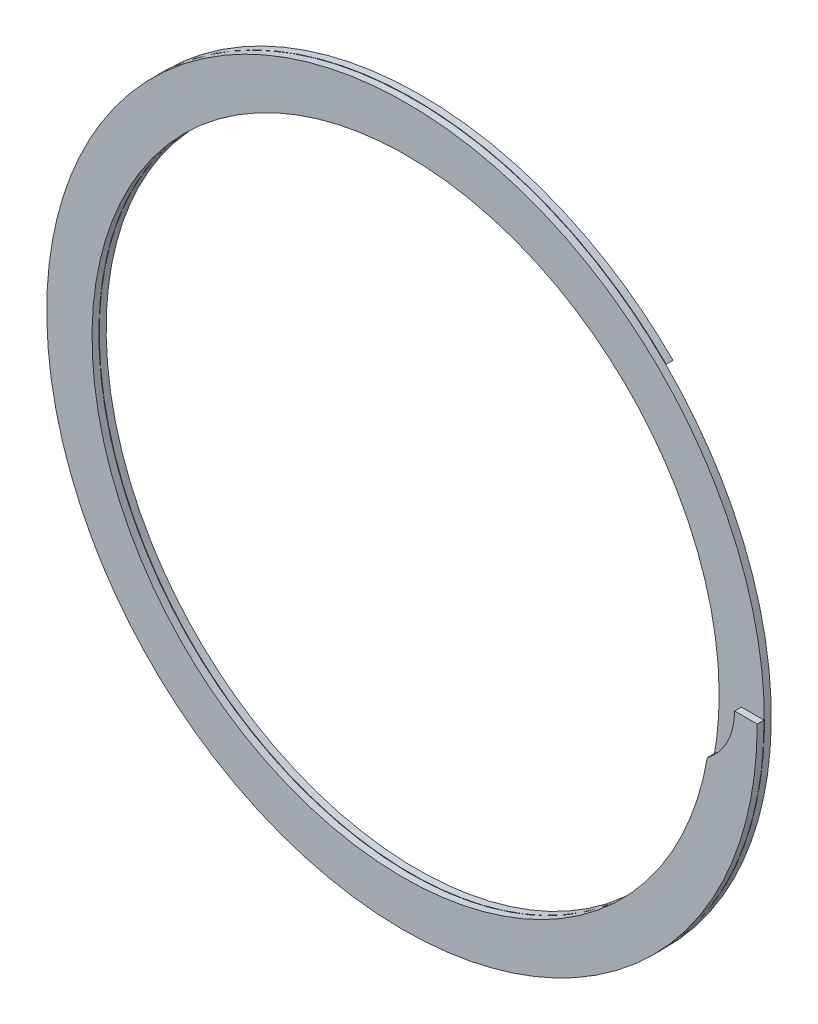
ISO-10303-21;
HEADER;
FILE_DESCRIPTION(('STEP AP214'),'2;1');
FILE_NAME('part.step','',(''),(''),'','','');
FILE_SCHEMA(('AUTOMOTIVE_DESIGN { 1 0 10303 214 1 1 1 1 }'));
ENDSEC;
DATA;
#1=APPLICATION_CONTEXT('core data for automotive mechanical design processes');
#2=APPLICATION_PROTOCOL_DEFINITION('international standard','automotive_design',2000,#1);
#3=PRODUCT_CONTEXT('',#1,'mechanical');
#4=PRODUCT('Part','Part','',(#3));
#5=PRODUCT_RELATED_PRODUCT_CATEGORY('part','',(#4));
#6=PRODUCT_DEFINITION_FORMATION('','',#4);
#7=PRODUCT_DEFINITION_CONTEXT('part definition',#1,'design');
#8=PRODUCT_DEFINITION('design','',#6,#7);
#9=PRODUCT_DEFINITION_SHAPE('','',#8);
#10=(LENGTH_UNIT() NAMED_UNIT(*) SI_UNIT(.MILLI.,.METRE.));
#11=(NAMED_UNIT(*) PLANE_ANGLE_UNIT() SI_UNIT($,.RADIAN.));
#12=(NAMED_UNIT(*) SI_UNIT($,.STERADIAN.) SOLID_ANGLE_UNIT());
#13=UNCERTAINTY_MEASURE_WITH_UNIT(LENGTH_MEASURE(1.E-05),#10,'distance_accuracy_value','');
#14=(GEOMETRIC_REPRESENTATION_CONTEXT(3) GLOBAL_UNCERTAINTY_ASSIGNED_CONTEXT((#13)) GLOBAL_UNIT_ASSIGNED_CONTEXT((#10,
#11,#12)) REPRESENTATION_CONTEXT('',''));
#15=CARTESIAN_POINT('',(0.,0.,0.));
#16=DIRECTION('',(0.,0.,1.));
#17=DIRECTION('',(1.,0.,0.));
#18=AXIS2_PLACEMENT_3D('',#15,#16,#17);
#19=CARTESIAN_POINT('',(13.452423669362,13.4524236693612,-1.0006125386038));
#20=DIRECTION('',(-0.707107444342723,0.70710611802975,0.));
#21=DIRECTION('',(-0.70710611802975,-0.707107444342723,0.));
#22=AXIS2_PLACEMENT_3D('',#19,#20,#21);
#23=PLANE('',#22);
#24=CARTESIAN_POINT('',(12.599300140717,12.5992985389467,-0.727562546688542));
#25=CARTESIAN_POINT('',(12.5993001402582,12.5992985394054,-0.757901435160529));
#26=CARTESIAN_POINT('',(12.5993001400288,12.5992985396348,-0.788240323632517));
#27=CARTESIAN_POINT('',(12.5993001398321,12.5992985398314,-0.848918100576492));
#28=CARTESIAN_POINT('',(12.5993001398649,12.5992985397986,-0.879256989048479));
#29=CARTESIAN_POINT('',(12.5993001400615,12.599298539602,-0.970273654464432));
#30=CARTESIAN_POINT('',(12.5993001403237,12.5992985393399,-1.0309514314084));
#31=CARTESIAN_POINT('',(12.5993001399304,12.5992985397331,-1.09162920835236));
#32=B_SPLINE_CURVE_WITH_KNOTS('',3,(#24,#25,#26,#27,#28,#29,#30,#31),.UNSPECIFIED.,.F.,.F.,(4,2,
2,4),(0.,0.0910166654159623,0.182033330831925,0.36406666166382),.UNSPECIFIED.);
#33=CARTESIAN_POINT('',(12.5993130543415,12.5993106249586,-0.727562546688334));
#34=VERTEX_POINT('',#33);
#35=CARTESIAN_POINT('',(12.599312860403,12.5993108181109,-1.09162921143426));
#36=VERTEX_POINT('',#35);
#37=EDGE_CURVE('E102',#34,#36,#32,.T.);
#38=ORIENTED_EDGE('',*,*,#37,.T.);
#39=CARTESIAN_POINT('',(13.4524249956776,13.4524223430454,-1.09162921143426));
#40=CARTESIAN_POINT('',(11.7461761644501,11.7461738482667,-1.09162921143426));
#41=(BOUNDED_CURVE() B_SPLINE_CURVE(1,(#39,#40),.UNSPECIFIED.,.F.,
.F.) B_SPLINE_CURVE_WITH_KNOTS((2,2),(0.,1.),
.UNSPECIFIED.) CURVE() GEOMETRIC_REPRESENTATION_ITEM() RATIONAL_B_SPLINE_CURVE((0.949184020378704,0.949184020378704)) REPRESENTATION_ITEM(''));
#42=CARTESIAN_POINT('',(13.452423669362,13.4524236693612,-1.09162920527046));
#43=VERTEX_POINT('',#42);
#44=EDGE_CURVE('E111',#36,#43,#41,.F.);
#45=ORIENTED_EDGE('',*,*,#44,.T.);
#46=CARTESIAN_POINT('',(13.452423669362,13.4524236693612,-0.727562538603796));
#47=CARTESIAN_POINT('',(13.452423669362,13.4524236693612,-1.09162920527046));
#48=(BOUNDED_CURVE() B_SPLINE_CURVE(1,(#46,#47),.UNSPECIFIED.,.F.,
.F.) B_SPLINE_CURVE_WITH_KNOTS((2,2),(0.,1.),
.UNSPECIFIED.) CURVE() GEOMETRIC_REPRESENTATION_ITEM() RATIONAL_B_SPLINE_CURVE((0.949184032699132,0.949184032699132)) REPRESENTATION_ITEM(''));
#49=CARTESIAN_POINT('',(13.4524254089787,13.4524219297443,-0.727562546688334));
#50=VERTEX_POINT('',#49);
#51=EDGE_CURVE('E236',#43,#50,#48,.F.);
#52=ORIENTED_EDGE('',*,*,#51,.T.);
#53=CARTESIAN_POINT('',(11.7461765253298,11.7461734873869,-0.727562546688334));
#54=CARTESIAN_POINT('',(13.4524254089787,13.4524219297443,-0.727562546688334));
#55=(BOUNDED_CURVE() B_SPLINE_CURVE(1,(#53,#54),.UNSPECIFIED.,.F.,
.F.) B_SPLINE_CURVE_WITH_KNOTS((2,2),(0.,1.),
.UNSPECIFIED.) CURVE() GEOMETRIC_REPRESENTATION_ITEM() RATIONAL_B_SPLINE_CURVE((0.949184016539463,0.949184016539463)) REPRESENTATION_ITEM(''));
#56=EDGE_CURVE('E115',#50,#34,#55,.F.);
#57=ORIENTED_EDGE('',*,*,#56,.T.);
#58=EDGE_LOOP('',(#38,#45,#52,#57));
#59=FACE_BOUND('',#58,.T.);
#60=ADVANCED_FACE('F44',(#59),#23,.F.);
#61=CARTESIAN_POINT('',(16.6116,0.,-0.364066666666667));
#62=CARTESIAN_POINT('',(16.6116,-9.59071173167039,-0.396428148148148));
#63=CARTESIAN_POINT('',(8.3058,-14.3860675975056,-0.42878962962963));
#64=CARTESIAN_POINT('',(0.,-19.1814234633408,-0.461151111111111));
#65=CARTESIAN_POINT('',(-8.3058,-14.3860675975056,-0.493512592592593));
#66=CARTESIAN_POINT('',(-16.6116,-9.59071173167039,-0.525874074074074));
#67=CARTESIAN_POINT('',(-16.6116,0.,-0.558235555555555));
#68=CARTESIAN_POINT('',(-16.6116,9.59071173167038,-0.590597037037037));
#69=CARTESIAN_POINT('',(-8.30580000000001,14.3860675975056,-0.622958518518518));
#70=CARTESIAN_POINT('',(0.,19.1814234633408,-0.65532));
#71=CARTESIAN_POINT('',(8.30579999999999,14.3860675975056,-0.687681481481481));
#72=CARTESIAN_POINT('',(16.6116,9.5907117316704,-0.720042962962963));
#73=CARTESIAN_POINT('',(16.6116,0.,-0.752404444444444));
#74=CARTESIAN_POINT('',(16.6116,-9.59071173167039,-0.784765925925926));
#75=CARTESIAN_POINT('',(8.3058,-14.3860675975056,-0.817127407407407));
#76=CARTESIAN_POINT('',(0.,-19.1814234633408,-0.849488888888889));
#77=CARTESIAN_POINT('',(-8.3058,-14.3860675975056,-0.88185037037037));
#78=CARTESIAN_POINT('',(-16.6116,-9.59071173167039,-0.914211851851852));
#79=CARTESIAN_POINT('',(-16.6116,0.,-0.946573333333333));
#80=CARTESIAN_POINT('',(-16.6116,9.59071173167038,-0.978934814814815));
#81=CARTESIAN_POINT('',(-8.30580000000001,14.3860675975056,-1.0112962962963));
#82=CARTESIAN_POINT('',(0.,19.1814234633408,-1.04365777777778));
#83=CARTESIAN_POINT('',(8.30579999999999,14.3860675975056,-1.07601925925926));
#84=CARTESIAN_POINT('',(10.1997626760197,13.2925877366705,-1.08339861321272));
#85=CARTESIAN_POINT('',(11.7461765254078,11.7461734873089,-1.09162921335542));
#86=CARTESIAN_POINT('',(16.6116,0.,0.));
#87=CARTESIAN_POINT('',(16.6116,-9.59071173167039,-0.0323614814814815));
#88=CARTESIAN_POINT('',(8.3058,-14.3860675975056,-0.064722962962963));
#89=CARTESIAN_POINT('',(0.,-19.1814234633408,-0.0970844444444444));
#90=CARTESIAN_POINT('',(-8.3058,-14.3860675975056,-0.129445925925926));
#91=CARTESIAN_POINT('',(-16.6116,-9.59071173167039,-0.161807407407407));
#92=CARTESIAN_POINT('',(-16.6116,0.,-0.194168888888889));
#93=CARTESIAN_POINT('',(-16.6116,9.59071173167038,-0.22653037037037));
#94=CARTESIAN_POINT('',(-8.30580000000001,14.3860675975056,-0.258891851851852));
#95=CARTESIAN_POINT('',(0.,19.1814234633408,-0.291253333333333));
#96=CARTESIAN_POINT('',(8.30579999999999,14.3860675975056,-0.323614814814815));
#97=CARTESIAN_POINT('',(16.6116,9.5907117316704,-0.355976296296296));
#98=CARTESIAN_POINT('',(16.6116,0.,-0.388337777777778));
#99=CARTESIAN_POINT('',(16.6116,-9.59071173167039,-0.420699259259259));
#100=CARTESIAN_POINT('',(8.3058,-14.3860675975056,-0.453060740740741));
#101=CARTESIAN_POINT('',(0.,-19.1814234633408,-0.485422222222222));
#102=CARTESIAN_POINT('',(-8.3058,-14.3860675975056,-0.517783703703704));
#103=CARTESIAN_POINT('',(-16.6116,-9.59071173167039,-0.550145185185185));
#104=CARTESIAN_POINT('',(-16.6116,0.,-0.582506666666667));
#105=CARTESIAN_POINT('',(-16.6116,9.59071173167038,-0.614868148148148));
#106=CARTESIAN_POINT('',(-8.30580000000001,14.3860675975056,-0.64722962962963));
#107=CARTESIAN_POINT('',(0.,19.1814234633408,-0.679591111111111));
#108=CARTESIAN_POINT('',(8.30579999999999,14.3860675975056,-0.711952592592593));
#109=CARTESIAN_POINT('',(10.1997626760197,13.2925877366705,-0.71933194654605));
#110=CARTESIAN_POINT('',(11.7461765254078,11.7461734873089,-0.727562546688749));
#111=(BOUNDED_SURFACE() B_SPLINE_SURFACE(1,2,((#61,#62,#63,#64,#65,#66,#67,#68,#69,#70,#71,#72,
#73,#74,#75,#76,#77,#78,#79,#80,#81,#82,#83,#84,#85),(#86,#87,#88,#89,#90,#91,#92,#93,#94,#95,
#96,#97,#98,#99,#100,#101,#102,#103,#104,#105,#106,#107,#108,#109,#110)),.UNSPECIFIED.,.F.,.F.,
.F.) B_SPLINE_SURFACE_WITH_KNOTS((2,2),(3,2,2,2,2,2,2,2,2,2,2,2,3),(0.,1.),(0.,
0.0833333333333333,0.166666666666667,0.25,0.333333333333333,0.416666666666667,0.5,
0.583333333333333,0.666666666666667,0.75,0.833333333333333,0.916666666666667,0.93786110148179),
.UNSPECIFIED.) GEOMETRIC_REPRESENTATION_ITEM() RATIONAL_B_SPLINE_SURFACE(((1.,0.866025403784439,
1.,0.866025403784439,1.,0.866025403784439,1.,0.866025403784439,1.,0.866025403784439,1.,
0.866025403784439,1.,0.866025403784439,1.,0.866025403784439,1.,0.866025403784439,1.,
0.866025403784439,1.,0.866025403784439,1.,0.965925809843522,0.949184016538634),(1.,
0.866025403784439,1.,0.866025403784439,1.,0.866025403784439,1.,0.866025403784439,1.,
0.866025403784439,1.,0.866025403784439,1.,0.866025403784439,1.,0.866025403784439,1.,
0.866025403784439,1.,0.866025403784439,1.,0.866025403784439,1.,0.965925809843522,0.949184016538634))) REPRESENTATION_ITEM('') SURFACE());
#112=DIRECTION('',(-1.47160528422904E-09,2.90979118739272E-09,1.));
#113=VECTOR('',#112,1.);
#114=CARTESIAN_POINT('',(9.52802344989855,13.6074262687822,-1.09162921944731));
#115=LINE('',#114,#113);
#116=CARTESIAN_POINT('',(9.52802233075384,13.6074260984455,-1.08102763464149));
#117=VERTEX_POINT('',#116);
#118=CARTESIAN_POINT('',(9.52802232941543,13.6074260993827,-0.716960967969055));
#119=VERTEX_POINT('',#118);
#120=EDGE_CURVE('E66',#117,#119,#115,.T.);
#121=CARTESIAN_POINT('',(16.6116,0.,0.));
#122=CARTESIAN_POINT('',(16.6116,-9.59071173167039,-0.0323614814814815));
#123=CARTESIAN_POINT('',(8.3058,-14.3860675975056,-0.064722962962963));
#124=CARTESIAN_POINT('',(0.,-19.1814234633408,-0.0970844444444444));
#125=CARTESIAN_POINT('',(-8.3058,-14.3860675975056,-0.129445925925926));
#126=CARTESIAN_POINT('',(-16.6116,-9.59071173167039,-0.161807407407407));
#127=CARTESIAN_POINT('',(-16.6116,0.,-0.194168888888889));
#128=CARTESIAN_POINT('',(-16.6116,9.59071173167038,-0.22653037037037));
#129=CARTESIAN_POINT('',(-8.30580000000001,14.3860675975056,-0.258891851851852));
#130=CARTESIAN_POINT('',(0.,19.1814234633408,-0.291253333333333));
#131=CARTESIAN_POINT('',(8.30579999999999,14.3860675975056,-0.323614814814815));
#132=CARTESIAN_POINT('',(16.6116,9.5907117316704,-0.355976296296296));
#133=CARTESIAN_POINT('',(16.6116,0.,-0.388337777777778));
#134=CARTESIAN_POINT('',(16.6116,-9.59071173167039,-0.420699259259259));
#135=CARTESIAN_POINT('',(8.3058,-14.3860675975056,-0.453060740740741));
#136=CARTESIAN_POINT('',(0.,-19.1814234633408,-0.485422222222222));
#137=CARTESIAN_POINT('',(-8.3058,-14.3860675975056,-0.517783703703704));
#138=CARTESIAN_POINT('',(-16.6116,-9.59071173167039,-0.550145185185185));
#139=CARTESIAN_POINT('',(-16.6116,0.,-0.582506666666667));
#140=CARTESIAN_POINT('',(-16.6116,9.59071173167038,-0.614868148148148));
#141=CARTESIAN_POINT('',(-8.30580000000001,14.3860675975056,-0.64722962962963));
#142=CARTESIAN_POINT('',(0.,19.1814234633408,-0.679591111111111));
#143=CARTESIAN_POINT('',(8.30579999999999,14.3860675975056,-0.711952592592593));
#144=CARTESIAN_POINT('',(10.1997626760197,13.2925877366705,-0.71933194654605));
#145=CARTESIAN_POINT('',(11.7461765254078,11.7461734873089,-0.727562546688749));
#146=(BOUNDED_CURVE() B_SPLINE_CURVE(2,(#121,#122,#123,#124,#125,#126,#127,#128,#129,#130,#131,
#132,#133,#134,#135,#136,#137,#138,#139,#140,#141,#142,#143,#144,#145),.UNSPECIFIED.,.F.,
.F.) B_SPLINE_CURVE_WITH_KNOTS((3,2,2,2,2,2,2,2,2,2,2,2,3),(0.,0.0833333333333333,
0.166666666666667,0.25,0.333333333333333,0.416666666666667,0.5,0.583333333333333,
0.666666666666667,0.75,0.833333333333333,0.916666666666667,0.93786110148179),
.UNSPECIFIED.) CURVE() GEOMETRIC_REPRESENTATION_ITEM() RATIONAL_B_SPLINE_CURVE((1.,
0.866025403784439,1.,0.866025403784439,1.,0.866025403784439,1.,0.866025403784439,1.,
0.866025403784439,1.,0.866025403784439,1.,0.866025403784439,1.,0.866025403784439,1.,
0.866025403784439,1.,0.866025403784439,1.,0.866025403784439,1.,0.965925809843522,0.949184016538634)) REPRESENTATION_ITEM(''));
#147=CARTESIAN_POINT('',(16.3592324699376,-2.88457406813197,-0.0102249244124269));
#148=VERTEX_POINT('',#147);
#149=EDGE_CURVE('E242',#148,#119,#146,.T.);
#150=DIRECTION('',(0.,0.,-1.));
#151=VECTOR('',#150,1.);
#152=CARTESIAN_POINT('',(16.3592324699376,-2.88457406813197,0.));
#153=LINE('',#152,#151);
#154=CARTESIAN_POINT('',(16.3592324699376,-2.88457406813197,-0.374291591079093));
#155=VERTEX_POINT('',#154);
#156=EDGE_CURVE('E396',#148,#155,#153,.T.);
#157=CARTESIAN_POINT('',(16.6116,0.,-0.364066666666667));
#158=CARTESIAN_POINT('',(16.6116,-9.59071173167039,-0.396428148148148));
#159=CARTESIAN_POINT('',(8.3058,-14.3860675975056,-0.42878962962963));
#160=CARTESIAN_POINT('',(0.,-19.1814234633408,-0.461151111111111));
#161=CARTESIAN_POINT('',(-8.3058,-14.3860675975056,-0.493512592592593));
#162=CARTESIAN_POINT('',(-16.6116,-9.59071173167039,-0.525874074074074));
#163=CARTESIAN_POINT('',(-16.6116,0.,-0.558235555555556));
#164=CARTESIAN_POINT('',(-16.6116,9.59071173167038,-0.590597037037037));
#165=CARTESIAN_POINT('',(-8.30580000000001,14.3860675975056,-0.622958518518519));
#166=CARTESIAN_POINT('',(0.,19.1814234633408,-0.65532));
#167=CARTESIAN_POINT('',(8.30579999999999,14.3860675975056,-0.687681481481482));
#168=CARTESIAN_POINT('',(16.6116,9.5907117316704,-0.720042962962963));
#169=CARTESIAN_POINT('',(16.6116,0.,-0.752404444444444));
#170=CARTESIAN_POINT('',(16.6116,-9.59071173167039,-0.784765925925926));
#171=CARTESIAN_POINT('',(8.3058,-14.3860675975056,-0.817127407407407));
#172=CARTESIAN_POINT('',(0.,-19.1814234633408,-0.849488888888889));
#173=CARTESIAN_POINT('',(-8.3058,-14.3860675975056,-0.88185037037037));
#174=CARTESIAN_POINT('',(-16.6116,-9.59071173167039,-0.914211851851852));
#175=CARTESIAN_POINT('',(-16.6116,0.,-0.946573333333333));
#176=CARTESIAN_POINT('',(-16.6116,9.59071173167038,-0.978934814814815));
#177=CARTESIAN_POINT('',(-8.30580000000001,14.3860675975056,-1.0112962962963));
#178=CARTESIAN_POINT('',(0.,19.1814234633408,-1.04365777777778));
#179=CARTESIAN_POINT('',(8.30579999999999,14.3860675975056,-1.07601925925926));
#180=CARTESIAN_POINT('',(10.199762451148,13.2925878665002,-1.08339861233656));
#181=CARTESIAN_POINT('',(11.7461761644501,11.7461738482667,-1.09162921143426));
#182=(BOUNDED_CURVE() B_SPLINE_CURVE(2,(#157,#158,#159,#160,#161,#162,#163,#164,#165,#166,#167,
#168,#169,#170,#171,#172,#173,#174,#175,#176,#177,#178,#179,#180,#181),.UNSPECIFIED.,.F.,
.F.) B_SPLINE_CURVE_WITH_KNOTS((3,2,2,2,2,2,2,2,2,2,2,2,3),(0.,0.0833333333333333,
0.166666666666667,0.25,0.333333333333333,0.416666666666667,0.5,0.583333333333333,
0.666666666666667,0.75,0.833333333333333,0.916666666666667,0.937861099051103),
.UNSPECIFIED.) CURVE() GEOMETRIC_REPRESENTATION_ITEM() RATIONAL_B_SPLINE_CURVE((1.,
0.866025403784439,1.,0.866025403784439,1.,0.866025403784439,1.,0.866025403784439,1.,
0.866025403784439,1.,0.866025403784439,1.,0.866025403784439,1.,0.866025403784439,1.,
0.866025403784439,1.,0.866025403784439,1.,0.866025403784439,1.,0.965925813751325,0.949184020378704)) REPRESENTATION_ITEM(''));
#183=EDGE_CURVE('E124',#155,#117,#182,.T.);
#184=ORIENTED_EDGE('',*,*,#120,.T.);
#185=ORIENTED_EDGE('',*,*,#149,.F.);
#186=ORIENTED_EDGE('',*,*,#156,.T.);
#187=ORIENTED_EDGE('',*,*,#183,.T.);
#188=EDGE_LOOP('',(#184,#185,#186,#187));
#189=FACE_BOUND('',#188,.T.);
#190=ADVANCED_FACE('F155',(#189),#111,.F.);
#191=CARTESIAN_POINT('',(19.0246,0.,-0.364066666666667));
#192=CARTESIAN_POINT('',(19.0246,-10.983857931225,-0.396428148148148));
#193=CARTESIAN_POINT('',(9.5123,-16.4757868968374,-0.42878962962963));
#194=CARTESIAN_POINT('',(0.,-21.9677158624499,-0.461151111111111));
#195=CARTESIAN_POINT('',(-9.5123,-16.4757868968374,-0.493512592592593));
#196=CARTESIAN_POINT('',(-19.0246,-10.983857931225,-0.525874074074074));
#197=CARTESIAN_POINT('',(-19.0246,0.,-0.558235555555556));
#198=CARTESIAN_POINT('',(-19.0246,10.983857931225,-0.590597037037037));
#199=CARTESIAN_POINT('',(-9.51230000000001,16.4757868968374,-0.622958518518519));
#200=CARTESIAN_POINT('',(0.,21.9677158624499,-0.65532));
#201=CARTESIAN_POINT('',(9.51229999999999,16.4757868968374,-0.687681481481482));
#202=CARTESIAN_POINT('',(19.0246,10.983857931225,-0.720042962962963));
#203=CARTESIAN_POINT('',(19.0246,0.,-0.752404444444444));
#204=CARTESIAN_POINT('',(19.0246,-10.983857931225,-0.784765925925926));
#205=CARTESIAN_POINT('',(9.5123,-16.4757868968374,-0.817127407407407));
#206=CARTESIAN_POINT('',(0.,-21.9677158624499,-0.849488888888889));
#207=CARTESIAN_POINT('',(-9.5123,-16.4757868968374,-0.88185037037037));
#208=CARTESIAN_POINT('',(-19.0246,-10.983857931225,-0.914211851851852));
#209=CARTESIAN_POINT('',(-19.0246,0.,-0.946573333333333));
#210=CARTESIAN_POINT('',(-19.0246,10.983857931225,-0.978934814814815));
#211=CARTESIAN_POINT('',(-9.51230000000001,16.4757868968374,-1.0112962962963));
#212=CARTESIAN_POINT('',(0.,21.9677158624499,-1.04365777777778));
#213=CARTESIAN_POINT('',(9.51229999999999,16.4757868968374,-1.07601925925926));
#214=CARTESIAN_POINT('',(11.6813793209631,15.2234683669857,-1.08339861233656));
#215=CARTESIAN_POINT('',(13.4524249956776,13.4524223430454,-1.09162921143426));
#216=CARTESIAN_POINT('',(16.6116,0.,-0.364066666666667));
#217=CARTESIAN_POINT('',(16.6116,-9.59071173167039,-0.396428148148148));
#218=CARTESIAN_POINT('',(8.3058,-14.3860675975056,-0.42878962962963));
#219=CARTESIAN_POINT('',(0.,-19.1814234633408,-0.461151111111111));
#220=CARTESIAN_POINT('',(-8.3058,-14.3860675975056,-0.493512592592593));
#221=CARTESIAN_POINT('',(-16.6116,-9.59071173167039,-0.525874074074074));
#222=CARTESIAN_POINT('',(-16.6116,0.,-0.558235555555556));
#223=CARTESIAN_POINT('',(-16.6116,9.59071173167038,-0.590597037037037));
#224=CARTESIAN_POINT('',(-8.30580000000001,14.3860675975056,-0.622958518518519));
#225=CARTESIAN_POINT('',(0.,19.1814234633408,-0.65532));
#226=CARTESIAN_POINT('',(8.30579999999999,14.3860675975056,-0.687681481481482));
#227=CARTESIAN_POINT('',(16.6116,9.5907117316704,-0.720042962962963));
#228=CARTESIAN_POINT('',(16.6116,0.,-0.752404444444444));
#229=CARTESIAN_POINT('',(16.6116,-9.59071173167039,-0.784765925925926));
#230=CARTESIAN_POINT('',(8.3058,-14.3860675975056,-0.817127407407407));
#231=CARTESIAN_POINT('',(0.,-19.1814234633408,-0.849488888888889));
#232=CARTESIAN_POINT('',(-8.3058,-14.3860675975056,-0.88185037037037));
#233=CARTESIAN_POINT('',(-16.6116,-9.59071173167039,-0.914211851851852));
#234=CARTESIAN_POINT('',(-16.6116,0.,-0.946573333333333));
#235=CARTESIAN_POINT('',(-16.6116,9.59071173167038,-0.978934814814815));
#236=CARTESIAN_POINT('',(-8.30580000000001,14.3860675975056,-1.0112962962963));
#237=CARTESIAN_POINT('',(0.,19.1814234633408,-1.04365777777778));
#238=CARTESIAN_POINT('',(8.30579999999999,14.3860675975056,-1.07601925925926));
#239=CARTESIAN_POINT('',(10.199762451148,13.2925878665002,-1.08339861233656));
#240=CARTESIAN_POINT('',(11.7461761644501,11.7461738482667,-1.09162921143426));
#241=(BOUNDED_SURFACE() B_SPLINE_SURFACE(1,2,((#191,#192,#193,#194,#195,#196,#197,#198,#199,
#200,#201,#202,#203,#204,#205,#206,#207,#208,#209,#210,#211,#212,#213,#214,#215),(#216,#217,
#218,#219,#220,#221,#222,#223,#224,#225,#226,#227,#228,#229,#230,#231,#232,#233,#234,#235,#236,
#237,#238,#239,#240)),.UNSPECIFIED.,.F.,.F.,.F.) B_SPLINE_SURFACE_WITH_KNOTS((2,2),(3,2,2,2,2,2,
2,2,2,2,2,2,3),(0.,1.),(0.,0.0833333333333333,0.166666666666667,0.25,0.333333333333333,
0.416666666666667,0.5,0.583333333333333,0.666666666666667,0.75,0.833333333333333,
0.916666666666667,0.937861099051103),
.UNSPECIFIED.) GEOMETRIC_REPRESENTATION_ITEM() RATIONAL_B_SPLINE_SURFACE(((1.,0.866025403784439,
1.,0.866025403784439,1.,0.866025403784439,1.,0.866025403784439,1.,0.866025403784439,1.,
0.866025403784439,1.,0.866025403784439,1.,0.866025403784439,1.,0.866025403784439,1.,
0.866025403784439,1.,0.866025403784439,1.,0.965925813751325,0.949184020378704),(1.,
0.866025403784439,1.,0.866025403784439,1.,0.866025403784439,1.,0.866025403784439,1.,
0.866025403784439,1.,0.866025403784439,1.,0.866025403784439,1.,0.866025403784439,1.,
0.866025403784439,1.,0.866025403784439,1.,0.866025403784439,1.,0.965925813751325,0.949184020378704))) REPRESENTATION_ITEM('') SURFACE());
#242=CARTESIAN_POINT('',(9.52802344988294,13.6074262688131,-1.08102763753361));
#243=CARTESIAN_POINT('',(9.64876909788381,13.6257685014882,-1.08133981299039));
#244=CARTESIAN_POINT('',(9.77045577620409,13.6377511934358,-1.08166388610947));
#245=CARTESIAN_POINT('',(10.0146305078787,13.6492592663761,-1.08233343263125));
#246=CARTESIAN_POINT('',(10.1371195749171,13.6487633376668,-1.08267894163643));
#247=CARTESIAN_POINT('',(10.3606324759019,13.6366411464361,-1.08332761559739));
#248=CARTESIAN_POINT('',(10.4617652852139,13.6269214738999,-1.0836279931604));
#249=CARTESIAN_POINT('',(10.6628934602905,13.5990510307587,-1.08424010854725));
#250=CARTESIAN_POINT('',(10.7628885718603,13.5808984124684,-1.08455184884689));
#251=CARTESIAN_POINT('',(10.9610729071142,13.5361248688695,-1.08518588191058));
#252=CARTESIAN_POINT('',(11.0592603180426,13.5094958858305,-1.08550818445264));
#253=CARTESIAN_POINT('',(11.2528932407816,13.4476973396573,-1.08616205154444));
#254=CARTESIAN_POINT('',(11.3483391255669,13.4125289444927,-1.08649361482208));
#255=CARTESIAN_POINT('',(11.5346767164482,13.3346463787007,-1.08716013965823));
#256=CARTESIAN_POINT('',(11.6256109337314,13.2920339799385,-1.08749500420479));
#257=CARTESIAN_POINT('',(11.8036317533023,13.1994577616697,-1.08817071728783));
#258=CARTESIAN_POINT('',(11.890717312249,13.1494919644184,-1.08851156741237));
#259=CARTESIAN_POINT('',(12.1450704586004,12.9892871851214,-1.08954018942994));
#260=CARTESIAN_POINT('',(12.3060022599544,12.8685017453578,-1.09023605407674));
#261=CARTESIAN_POINT('',(12.4799581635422,12.7132922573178,-1.09105090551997));
#262=CARTESIAN_POINT('',(12.5042948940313,12.6909563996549,-1.09116648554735));
#263=CARTESIAN_POINT('',(12.5522963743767,12.6456271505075,-1.09139773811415));
#264=CARTESIAN_POINT('',(12.5759618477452,12.6226345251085,-1.09151341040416));
#265=CARTESIAN_POINT('',(12.5993001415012,12.5992985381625,-1.09162920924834));
#266=B_SPLINE_CURVE_WITH_KNOTS('',3,(#242,#243,#244,#245,#246,#247,#248,#249,#250,#251,#252,
#253,#254,#255,#256,#257,#258,#259,#260,#261,#262,#263,#264,#265),.UNSPECIFIED.,.F.,.F.,(4,2,2,
2,2,2,2,2,2,2,2,4),(0.,0.366197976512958,0.733021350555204,1.03748147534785,1.3420083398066,
1.6468255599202,1.9516011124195,2.25249633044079,2.55347262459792,3.15359686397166,
3.25269372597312,3.35167937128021),.UNSPECIFIED.);
#267=EDGE_CURVE('E59',#117,#36,#266,.T.);
#268=CARTESIAN_POINT('',(17.7102009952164,2.18235442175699,-0.357159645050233));
#269=CARTESIAN_POINT('',(17.7229068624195,1.9399773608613,-0.35793170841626));
#270=CARTESIAN_POINT('',(17.7356064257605,1.69759993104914,-0.358702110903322));
#271=CARTESIAN_POINT('',(17.750427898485,1.41477895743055,-0.359599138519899));
#272=CARTESIAN_POINT('',(17.752547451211,1.37433528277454,-0.359727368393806));
#273=CARTESIAN_POINT('',(17.7567867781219,1.29344784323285,-0.359983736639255));
#274=CARTESIAN_POINT('',(17.7589065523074,1.2530040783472,-0.360111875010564));
#275=CARTESIAN_POINT('',(17.7631454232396,1.17211034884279,-0.360368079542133));
#276=CARTESIAN_POINT('',(17.7652645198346,1.13166038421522,-0.360496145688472));
#277=CARTESIAN_POINT('',(17.7684459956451,1.07098570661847,-0.360688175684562));
#278=CARTESIAN_POINT('',(17.7695069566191,1.05076091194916,-0.360752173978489));
#279=CARTESIAN_POINT('',(17.7716237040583,1.01031105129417,-0.360880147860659));
#280=CARTESIAN_POINT('',(17.7726794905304,0.990085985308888,-0.360944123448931));
#281=CARTESIAN_POINT('',(17.7759618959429,0.929404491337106,-0.361136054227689));
#282=CARTESIAN_POINT('',(17.7783029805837,0.888954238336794,-0.361263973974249));
#283=CARTESIAN_POINT('',(17.7831246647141,0.808062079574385,-0.361519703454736));
#284=CARTESIAN_POINT('',(17.7856052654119,0.767620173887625,-0.361647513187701));
#285=CARTESIAN_POINT('',(17.7930530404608,0.646421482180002,-0.362030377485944));
#286=CARTESIAN_POINT('',(17.7980339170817,0.565665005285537,-0.36228526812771));
#287=CARTESIAN_POINT('',(17.8046965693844,0.444497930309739,-0.362667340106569));
#288=CARTESIAN_POINT('',(17.8067823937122,0.404110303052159,-0.362794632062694));
#289=CARTESIAN_POINT('',(17.8105429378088,0.323314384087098,-0.363049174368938));
#290=CARTESIAN_POINT('',(17.8122176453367,0.282906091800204,-0.363176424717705));
#291=CARTESIAN_POINT('',(17.8150157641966,0.202087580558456,-0.363430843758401));
#292=CARTESIAN_POINT('',(17.8161394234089,0.161677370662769,-0.3635580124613));
#293=CARTESIAN_POINT('',(17.8172916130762,0.101052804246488,-0.363748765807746));
#294=CARTESIAN_POINT('',(17.8175867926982,0.0808433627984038,-0.363812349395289));
#295=CARTESIAN_POINT('',(17.818000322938,0.0404226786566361,-0.363939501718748));
#296=CARTESIAN_POINT('',(17.8181186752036,0.0202114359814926,-0.364003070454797));
#297=CARTESIAN_POINT('',(17.8180858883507,-0.0152722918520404,-0.36411472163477));
#298=CARTESIAN_POINT('',(17.8179935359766,-0.0305447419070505,-0.36416279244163));
#299=CARTESIAN_POINT('',(17.8175942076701,-0.0610866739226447,-0.364259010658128));
#300=CARTESIAN_POINT('',(17.8172872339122,-0.0763561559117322,-0.364307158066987));
#301=CARTESIAN_POINT('',(17.8160683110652,-0.122155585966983,-0.364451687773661));
#302=CARTESIAN_POINT('',(17.8148583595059,-0.152678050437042,-0.364548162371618));
#303=CARTESIAN_POINT('',(17.8116423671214,-0.213678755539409,-0.364741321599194));
#304=CARTESIAN_POINT('',(17.8096363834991,-0.24415699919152,-0.364838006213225));
#305=CARTESIAN_POINT('',(17.8048406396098,-0.305052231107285,-0.36503155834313));
#306=CARTESIAN_POINT('',(17.8020508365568,-0.335469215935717,-0.365128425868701));
#307=CARTESIAN_POINT('',(17.7925123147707,-0.426641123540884,-0.365419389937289));
#308=CARTESIAN_POINT('',(17.7845964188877,-0.48728061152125,-0.365613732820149));
#309=CARTESIAN_POINT('',(17.7657164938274,-0.608081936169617,-0.36600275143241));
#310=CARTESIAN_POINT('',(17.7547513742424,-0.668243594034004,-0.366197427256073));
#311=CARTESIAN_POINT('',(17.7007720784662,-0.927336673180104,-0.367040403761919));
#312=CARTESIAN_POINT('',(17.6425476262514,-1.12346977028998,-0.367690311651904));
#313=CARTESIAN_POINT('',(17.5311206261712,-1.40776826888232,-0.368656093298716));
#314=CARTESIAN_POINT('',(17.4899560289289,-1.50089619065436,-0.368976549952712));
#315=CARTESIAN_POINT('',(17.3995511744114,-1.68320599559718,-0.369613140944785));
#316=CARTESIAN_POINT('',(17.3503110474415,-1.77238794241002,-0.369929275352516));
#317=CARTESIAN_POINT('',(17.2626041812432,-1.91625992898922,-0.370447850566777));
#318=CARTESIAN_POINT('',(17.2262578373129,-1.97226226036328,-0.370651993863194));
#319=CARTESIAN_POINT('',(17.1505092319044,-2.08217199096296,-0.371057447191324));
#320=CARTESIAN_POINT('',(17.1111068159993,-2.13607928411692,-0.371258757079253));
#321=CARTESIAN_POINT('',(17.0293992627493,-2.24164401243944,-0.371658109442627));
#322=CARTESIAN_POINT('',(16.9870940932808,-2.29330142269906,-0.371856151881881));
#323=CARTESIAN_POINT('',(16.8994917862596,-2.39448080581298,-0.372249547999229));
#324=CARTESIAN_POINT('',(16.8541805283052,-2.44399058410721,-0.372444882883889));
#325=CARTESIAN_POINT('',(16.7842238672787,-2.51630992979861,-0.372734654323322));
#326=CARTESIAN_POINT('',(16.7605747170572,-2.54009089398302,-0.372830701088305));
#327=CARTESIAN_POINT('',(16.7126229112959,-2.5869888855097,-0.373021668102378));
#328=CARTESIAN_POINT('',(16.6883202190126,-2.6101058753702,-0.373116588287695));
#329=CARTESIAN_POINT('',(16.6390881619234,-2.65564197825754,-0.37330517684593));
#330=CARTESIAN_POINT('',(16.6141590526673,-2.67806136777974,-0.373398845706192));
#331=CARTESIAN_POINT('',(16.5636814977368,-2.72218642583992,-0.373584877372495));
#332=CARTESIAN_POINT('',(16.5381331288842,-2.74389218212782,-0.37367724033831));
#333=CARTESIAN_POINT('',(16.4993772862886,-2.77587941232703,-0.373814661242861));
#334=CARTESIAN_POINT('',(16.4863975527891,-2.78643794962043,-0.373860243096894));
#335=CARTESIAN_POINT('',(16.460289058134,-2.80736843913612,-0.373951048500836));
#336=CARTESIAN_POINT('',(16.4471603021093,-2.81774039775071,-0.37399627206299));
#337=CARTESIAN_POINT('',(16.4207518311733,-2.83829366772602,-0.374086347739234));
#338=CARTESIAN_POINT('',(16.4074720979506,-2.84847495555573,-0.3741311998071));
#339=CARTESIAN_POINT('',(16.3874463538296,-2.86360673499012,-0.374198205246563));
#340=CARTESIAN_POINT('',(16.3807532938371,-2.8686273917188,-0.374220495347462));
#341=CARTESIAN_POINT('',(16.3673240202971,-2.87861072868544,-0.374264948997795));
#342=CARTESIAN_POINT('',(16.36058780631,-2.88357340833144,-0.374287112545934));
#343=CARTESIAN_POINT('',(16.340367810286,-2.89846085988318,-0.374353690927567));
#344=CARTESIAN_POINT('',(16.3268798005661,-2.90837978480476,-0.374398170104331));
#345=CARTESIAN_POINT('',(16.2999069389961,-2.92822156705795,-0.374487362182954));
#346=CARTESIAN_POINT('',(16.2864220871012,-2.93814442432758,-0.374532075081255));
#347=CARTESIAN_POINT('',(16.2459679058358,-2.96791100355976,-0.37466654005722));
#348=CARTESIAN_POINT('',(16.2189977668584,-2.98775360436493,-0.374756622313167));
#349=CARTESIAN_POINT('',(16.1650465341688,-3.027448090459,-0.374937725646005));
#350=CARTESIAN_POINT('',(16.1380654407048,-3.04729997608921,-0.375028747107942));
#351=CARTESIAN_POINT('',(16.0841027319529,-3.08700381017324,-0.375211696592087));
#352=CARTESIAN_POINT('',(16.0571211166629,-3.10685575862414,-0.375303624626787));
#353=CARTESIAN_POINT('',(15.9768423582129,-3.1659216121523,-0.37557849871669));
#354=CARTESIAN_POINT('',(15.9235452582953,-3.20513557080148,-0.375762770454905));
#355=CARTESIAN_POINT('',(15.8169803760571,-3.28354185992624,-0.376134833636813));
#356=CARTESIAN_POINT('',(15.763712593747,-3.32273419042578,-0.376322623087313));
#357=CARTESIAN_POINT('',(15.6572360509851,-3.40107542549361,-0.376701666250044));
#358=CARTESIAN_POINT('',(15.6040272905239,-3.44022433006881,-0.376892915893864));
#359=CARTESIAN_POINT('',(15.5508185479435,-3.47937325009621,-0.377086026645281));
#360=B_SPLINE_CURVE_WITH_KNOTS('',3,(#268,#269,#270,#271,#272,#273,#274,#275,#276,#277,#278,
#279,#280,#281,#282,#283,#284,#285,#286,#287,#288,#289,#290,#291,#292,#293,#294,#295,#296,#297,
#298,#299,#300,#301,#302,#303,#304,#305,#306,#307,#308,#309,#310,#311,#312,#313,#314,#315,#316,
#317,#318,#319,#320,#321,#322,#323,#324,#325,#326,#327,#328,#329,#330,#331,#332,#333,#334,#335,
#336,#337,#338,#339,#340,#341,#342,#343,#344,#345,#346,#347,#348,#349,#350,#351,#352,#353,#354,
#355,#356,#357,#358,#359),.UNSPECIFIED.,.F.,.F.,(4,2,2,2,2,2,2,2,2,2,2,2,2,2,2,2,2,2,2,2,2,2,2,
2,2,2,2,2,2,2,2,2,2,2,2,2,2,2,2,2,2,2,2,2,2,4),(0.,0.728133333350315,0.849631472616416,
0.971129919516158,1.09264681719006,1.15340494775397,1.21416299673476,1.33571654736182,
1.45727115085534,1.69999949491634,1.82132289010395,1.94264989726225,2.06392227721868,
2.12455673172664,2.18519062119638,2.23100776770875,2.27682445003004,2.36845321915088,
2.46007540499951,2.55170259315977,2.73506616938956,2.9184954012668,3.52869230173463,
3.83387346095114,4.13904969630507,4.33925110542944,4.53946263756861,4.73967638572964,
4.94090823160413,5.04151300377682,5.14212344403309,5.24269348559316,5.34325111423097,
5.39344558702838,5.44363833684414,5.49383724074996,5.51893759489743,5.54403820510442,
5.59426599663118,5.64449302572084,5.74494267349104,5.8454352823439,5.94592927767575,
6.14443656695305,6.34283459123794,6.5410128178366),.UNSPECIFIED.);
#361=CARTESIAN_POINT('',(17.8218632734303,0.,-0.364066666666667));
#362=VERTEX_POINT('',#361);
#363=EDGE_CURVE('E107',#362,#155,#360,.T.);
#364=DIRECTION('',(-1.,0.,0.));
#365=VECTOR('',#364,1.);
#366=CARTESIAN_POINT('',(17.8181,0.,-0.364066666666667));
#367=LINE('',#366,#365);
#368=CARTESIAN_POINT('',(19.0246,0.,-0.364066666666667));
#369=VERTEX_POINT('',#368);
#370=EDGE_CURVE('E125',#369,#362,#367,.T.);
#371=CARTESIAN_POINT('',(19.0246,0.,-0.364066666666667));
#372=CARTESIAN_POINT('',(19.0246,-10.983857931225,-0.396428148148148));
#373=CARTESIAN_POINT('',(9.5123,-16.4757868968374,-0.42878962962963));
#374=CARTESIAN_POINT('',(0.,-21.9677158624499,-0.461151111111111));
#375=CARTESIAN_POINT('',(-9.5123,-16.4757868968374,-0.493512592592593));
#376=CARTESIAN_POINT('',(-19.0246,-10.983857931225,-0.525874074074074));
#377=CARTESIAN_POINT('',(-19.0246,0.,-0.558235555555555));
#378=CARTESIAN_POINT('',(-19.0246,10.983857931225,-0.590597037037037));
#379=CARTESIAN_POINT('',(-9.51230000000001,16.4757868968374,-0.622958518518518));
#380=CARTESIAN_POINT('',(0.,21.9677158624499,-0.65532));
#381=CARTESIAN_POINT('',(9.51229999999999,16.4757868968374,-0.687681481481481));
#382=CARTESIAN_POINT('',(19.0246,10.983857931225,-0.720042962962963));
#383=CARTESIAN_POINT('',(19.0246,0.,-0.752404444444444));
#384=CARTESIAN_POINT('',(19.0246,-10.983857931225,-0.784765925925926));
#385=CARTESIAN_POINT('',(9.5123,-16.4757868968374,-0.817127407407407));
#386=CARTESIAN_POINT('',(0.,-21.9677158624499,-0.849488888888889));
#387=CARTESIAN_POINT('',(-9.5123,-16.4757868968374,-0.88185037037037));
#388=CARTESIAN_POINT('',(-19.0246,-10.983857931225,-0.914211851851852));
#389=CARTESIAN_POINT('',(-19.0246,0.,-0.946573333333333));
#390=CARTESIAN_POINT('',(-19.0246,10.983857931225,-0.978934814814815));
#391=CARTESIAN_POINT('',(-9.51230000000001,16.4757868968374,-1.0112962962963));
#392=CARTESIAN_POINT('',(0.,21.9677158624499,-1.04365777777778));
#393=CARTESIAN_POINT('',(9.51229999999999,16.4757868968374,-1.07601925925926));
#394=CARTESIAN_POINT('',(11.6813784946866,15.2234688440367,-1.08339860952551));
#395=CARTESIAN_POINT('',(13.452423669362,13.4524236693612,-1.09162920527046));
#396=(BOUNDED_CURVE() B_SPLINE_CURVE(2,(#371,#372,#373,#374,#375,#376,#377,#378,#379,#380,#381,
#382,#383,#384,#385,#386,#387,#388,#389,#390,#391,#392,#393,#394,#395),.UNSPECIFIED.,.F.,
.F.) B_SPLINE_CURVE_WITH_KNOTS((3,2,2,2,2,2,2,2,2,2,2,2,3),(0.,0.0833333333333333,
0.166666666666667,0.25,0.333333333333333,0.416666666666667,0.5,0.583333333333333,
0.666666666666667,0.75,0.833333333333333,0.916666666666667,0.937861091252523),
.UNSPECIFIED.) CURVE() GEOMETRIC_REPRESENTATION_ITEM() RATIONAL_B_SPLINE_CURVE((1.,
0.866025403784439,1.,0.866025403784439,1.,0.866025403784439,1.,0.866025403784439,1.,
0.866025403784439,1.,0.866025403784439,1.,0.866025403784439,1.,0.866025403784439,1.,
0.866025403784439,1.,0.866025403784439,1.,0.866025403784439,1.,0.965925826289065,0.949184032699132)) REPRESENTATION_ITEM(''));
#397=EDGE_CURVE('E122',#369,#43,#396,.T.);
#398=ORIENTED_EDGE('',*,*,#267,.F.);
#399=ORIENTED_EDGE('',*,*,#183,.F.);
#400=ORIENTED_EDGE('',*,*,#363,.F.);
#401=ORIENTED_EDGE('',*,*,#370,.F.);
#402=ORIENTED_EDGE('',*,*,#397,.T.);
#403=ORIENTED_EDGE('',*,*,#44,.F.);
#404=EDGE_LOOP('',(#398,#399,#400,#401,#402,#403));
#405=FACE_BOUND('',#404,.T.);
#406=ADVANCED_FACE('F120',(#405),#241,.F.);
#407=CARTESIAN_POINT('',(19.0246,0.,-0.182033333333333));
#408=DIRECTION('',(0.,1.,0.));
#409=DIRECTION('',(0.,0.,1.));
#410=AXIS2_PLACEMENT_3D('',#407,#408,#409);
#411=PLANE('',#410);
#412=ORIENTED_EDGE('',*,*,#370,.T.);
#413=DIRECTION('',(0.,0.,-1.));
#414=VECTOR('',#413,1.);
#415=CARTESIAN_POINT('',(17.8181,0.,-0.182033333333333));
#416=LINE('',#415,#414);
#417=CARTESIAN_POINT('',(17.8218632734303,0.,0.));
#418=VERTEX_POINT('',#417);
#419=EDGE_CURVE('E117',#362,#418,#416,.F.);
#420=ORIENTED_EDGE('',*,*,#419,.T.);
#421=DIRECTION('',(1.,0.,0.));
#422=VECTOR('',#421,1.);
#423=CARTESIAN_POINT('',(17.8181,0.,0.));
#424=LINE('',#423,#422);
#425=CARTESIAN_POINT('',(19.0246,0.,0.));
#426=VERTEX_POINT('',#425);
#427=EDGE_CURVE('E246',#418,#426,#424,.T.);
#428=ORIENTED_EDGE('',*,*,#427,.T.);
#429=DIRECTION('',(0.,0.,-1.));
#430=VECTOR('',#429,1.);
#431=CARTESIAN_POINT('',(19.0246,0.,-0.182033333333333));
#432=LINE('',#431,#430);
#433=EDGE_CURVE('E228',#426,#369,#432,.T.);
#434=ORIENTED_EDGE('',*,*,#433,.T.);
#435=EDGE_LOOP('',(#412,#420,#428,#434));
#436=FACE_BOUND('',#435,.T.);
#437=ADVANCED_FACE('F154',(#436),#411,.T.);
#438=CARTESIAN_POINT('',(19.0246,0.,0.));
#439=CARTESIAN_POINT('',(19.0246,-10.983857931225,-0.0323614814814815));
#440=CARTESIAN_POINT('',(9.5123,-16.4757868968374,-0.064722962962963));
#441=CARTESIAN_POINT('',(0.,-21.9677158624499,-0.0970844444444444));
#442=CARTESIAN_POINT('',(-9.5123,-16.4757868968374,-0.129445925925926));
#443=CARTESIAN_POINT('',(-19.0246,-10.983857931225,-0.161807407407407));
#444=CARTESIAN_POINT('',(-19.0246,0.,-0.194168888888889));
#445=CARTESIAN_POINT('',(-19.0246,10.983857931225,-0.22653037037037));
#446=CARTESIAN_POINT('',(-9.51230000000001,16.4757868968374,-0.258891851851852));
#447=CARTESIAN_POINT('',(0.,21.9677158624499,-0.291253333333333));
#448=CARTESIAN_POINT('',(9.51229999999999,16.4757868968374,-0.323614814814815));
#449=CARTESIAN_POINT('',(19.0246,10.983857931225,-0.355976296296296));
#450=CARTESIAN_POINT('',(19.0246,0.,-0.388337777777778));
#451=CARTESIAN_POINT('',(19.0246,-10.983857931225,-0.420699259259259));
#452=CARTESIAN_POINT('',(9.5123,-16.4757868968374,-0.453060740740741));
#453=CARTESIAN_POINT('',(0.,-21.9677158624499,-0.485422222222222));
#454=CARTESIAN_POINT('',(-9.5123,-16.4757868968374,-0.517783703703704));
#455=CARTESIAN_POINT('',(-19.0246,-10.983857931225,-0.550145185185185));
#456=CARTESIAN_POINT('',(-19.0246,0.,-0.582506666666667));
#457=CARTESIAN_POINT('',(-19.0246,10.983857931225,-0.614868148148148));
#458=CARTESIAN_POINT('',(-9.51230000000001,16.4757868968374,-0.64722962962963));
#459=CARTESIAN_POINT('',(0.,21.9677158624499,-0.679591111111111));
#460=CARTESIAN_POINT('',(9.51229999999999,16.4757868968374,-0.711952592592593));
#461=CARTESIAN_POINT('',(11.6813784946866,15.2234688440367,-0.719331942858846));
#462=CARTESIAN_POINT('',(13.452423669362,13.4524236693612,-0.727562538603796));
#463=CARTESIAN_POINT('',(19.0246,0.,-0.364066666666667));
#464=CARTESIAN_POINT('',(19.0246,-10.983857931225,-0.396428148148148));
#465=CARTESIAN_POINT('',(9.5123,-16.4757868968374,-0.42878962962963));
#466=CARTESIAN_POINT('',(0.,-21.9677158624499,-0.461151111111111));
#467=CARTESIAN_POINT('',(-9.5123,-16.4757868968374,-0.493512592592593));
#468=CARTESIAN_POINT('',(-19.0246,-10.983857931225,-0.525874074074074));
#469=CARTESIAN_POINT('',(-19.0246,0.,-0.558235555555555));
#470=CARTESIAN_POINT('',(-19.0246,10.983857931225,-0.590597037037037));
#471=CARTESIAN_POINT('',(-9.51230000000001,16.4757868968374,-0.622958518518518));
#472=CARTESIAN_POINT('',(0.,21.9677158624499,-0.65532));
#473=CARTESIAN_POINT('',(9.51229999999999,16.4757868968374,-0.687681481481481));
#474=CARTESIAN_POINT('',(19.0246,10.983857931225,-0.720042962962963));
#475=CARTESIAN_POINT('',(19.0246,0.,-0.752404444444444));
#476=CARTESIAN_POINT('',(19.0246,-10.983857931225,-0.784765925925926));
#477=CARTESIAN_POINT('',(9.5123,-16.4757868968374,-0.817127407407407));
#478=CARTESIAN_POINT('',(0.,-21.9677158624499,-0.849488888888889));
#479=CARTESIAN_POINT('',(-9.5123,-16.4757868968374,-0.88185037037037));
#480=CARTESIAN_POINT('',(-19.0246,-10.983857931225,-0.914211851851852));
#481=CARTESIAN_POINT('',(-19.0246,0.,-0.946573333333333));
#482=CARTESIAN_POINT('',(-19.0246,10.983857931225,-0.978934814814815));
#483=CARTESIAN_POINT('',(-9.51230000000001,16.4757868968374,-1.0112962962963));
#484=CARTESIAN_POINT('',(0.,21.9677158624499,-1.04365777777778));
#485=CARTESIAN_POINT('',(9.51229999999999,16.4757868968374,-1.07601925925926));
#486=CARTESIAN_POINT('',(11.6813784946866,15.2234688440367,-1.08339860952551));
#487=CARTESIAN_POINT('',(13.452423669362,13.4524236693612,-1.09162920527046));
#488=(BOUNDED_SURFACE() B_SPLINE_SURFACE(1,2,((#438,#439,#440,#441,#442,#443,#444,#445,#446,
#447,#448,#449,#450,#451,#452,#453,#454,#455,#456,#457,#458,#459,#460,#461,#462),(#463,#464,
#465,#466,#467,#468,#469,#470,#471,#472,#473,#474,#475,#476,#477,#478,#479,#480,#481,#482,#483,
#484,#485,#486,#487)),.UNSPECIFIED.,.F.,.F.,.F.) B_SPLINE_SURFACE_WITH_KNOTS((2,2),(3,2,2,2,2,2,
2,2,2,2,2,2,3),(0.,1.),(0.,0.0833333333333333,0.166666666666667,0.25,0.333333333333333,
0.416666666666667,0.5,0.583333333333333,0.666666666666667,0.75,0.833333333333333,
0.916666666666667,0.937861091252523),
.UNSPECIFIED.) GEOMETRIC_REPRESENTATION_ITEM() RATIONAL_B_SPLINE_SURFACE(((1.,0.866025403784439,
1.,0.866025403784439,1.,0.866025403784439,1.,0.866025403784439,1.,0.866025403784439,1.,
0.866025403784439,1.,0.866025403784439,1.,0.866025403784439,1.,0.866025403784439,1.,
0.866025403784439,1.,0.866025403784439,1.,0.965925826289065,0.949184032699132),(1.,
0.866025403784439,1.,0.866025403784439,1.,0.866025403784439,1.,0.866025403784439,1.,
0.866025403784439,1.,0.866025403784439,1.,0.866025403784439,1.,0.866025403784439,1.,
0.866025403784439,1.,0.866025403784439,1.,0.866025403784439,1.,0.965925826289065,0.949184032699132))) REPRESENTATION_ITEM('') SURFACE());
#489=CARTESIAN_POINT('',(19.0246,0.,0.));
#490=CARTESIAN_POINT('',(19.0246,-10.983857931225,-0.0323614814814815));
#491=CARTESIAN_POINT('',(9.5123,-16.4757868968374,-0.064722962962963));
#492=CARTESIAN_POINT('',(0.,-21.9677158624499,-0.0970844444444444));
#493=CARTESIAN_POINT('',(-9.5123,-16.4757868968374,-0.129445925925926));
#494=CARTESIAN_POINT('',(-19.0246,-10.983857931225,-0.161807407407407));
#495=CARTESIAN_POINT('',(-19.0246,0.,-0.194168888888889));
#496=CARTESIAN_POINT('',(-19.0246,10.983857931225,-0.22653037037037));
#497=CARTESIAN_POINT('',(-9.51230000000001,16.4757868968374,-0.258891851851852));
#498=CARTESIAN_POINT('',(0.,21.9677158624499,-0.291253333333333));
#499=CARTESIAN_POINT('',(9.51229999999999,16.4757868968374,-0.323614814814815));
#500=CARTESIAN_POINT('',(19.0246,10.983857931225,-0.355976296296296));
#501=CARTESIAN_POINT('',(19.0246,0.,-0.388337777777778));
#502=CARTESIAN_POINT('',(19.0246,-10.983857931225,-0.420699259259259));
#503=CARTESIAN_POINT('',(9.5123,-16.4757868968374,-0.453060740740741));
#504=CARTESIAN_POINT('',(0.,-21.9677158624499,-0.485422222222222));
#505=CARTESIAN_POINT('',(-9.5123,-16.4757868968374,-0.517783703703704));
#506=CARTESIAN_POINT('',(-19.0246,-10.983857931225,-0.550145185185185));
#507=CARTESIAN_POINT('',(-19.0246,0.,-0.582506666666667));
#508=CARTESIAN_POINT('',(-19.0246,10.983857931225,-0.614868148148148));
#509=CARTESIAN_POINT('',(-9.51230000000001,16.4757868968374,-0.64722962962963));
#510=CARTESIAN_POINT('',(0.,21.9677158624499,-0.679591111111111));
#511=CARTESIAN_POINT('',(9.51229999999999,16.4757868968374,-0.711952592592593));
#512=CARTESIAN_POINT('',(11.681379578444,15.2234682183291,-0.719331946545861));
#513=CARTESIAN_POINT('',(13.4524254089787,13.4524219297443,-0.727562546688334));
#514=(BOUNDED_CURVE() B_SPLINE_CURVE(2,(#489,#490,#491,#492,#493,#494,#495,#496,#497,#498,#499,
#500,#501,#502,#503,#504,#505,#506,#507,#508,#509,#510,#511,#512,#513),.UNSPECIFIED.,.F.,
.F.) B_SPLINE_CURVE_WITH_KNOTS((3,2,2,2,2,2,2,2,2,2,2,2,3),(0.,0.0833333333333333,
0.166666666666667,0.25,0.333333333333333,0.416666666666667,0.5,0.583333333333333,
0.666666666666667,0.75,0.833333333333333,0.916666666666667,0.937861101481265),
.UNSPECIFIED.) CURVE() GEOMETRIC_REPRESENTATION_ITEM() RATIONAL_B_SPLINE_CURVE((1.,
0.866025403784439,1.,0.866025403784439,1.,0.866025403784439,1.,0.866025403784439,1.,
0.866025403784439,1.,0.866025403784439,1.,0.866025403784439,1.,0.866025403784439,1.,
0.866025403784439,1.,0.866025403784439,1.,0.866025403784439,1.,0.965925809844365,0.949184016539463)) REPRESENTATION_ITEM(''));
#515=EDGE_CURVE('E258',#426,#50,#514,.T.);
#516=ORIENTED_EDGE('',*,*,#433,.F.);
#517=ORIENTED_EDGE('',*,*,#515,.T.);
#518=ORIENTED_EDGE('',*,*,#51,.F.);
#519=ORIENTED_EDGE('',*,*,#397,.F.);
#520=EDGE_LOOP('',(#516,#517,#518,#519));
#521=FACE_BOUND('',#520,.T.);
#522=ADVANCED_FACE('F305',(#521),#488,.F.);
#523=CARTESIAN_POINT('',(16.6116,0.,0.));
#524=CARTESIAN_POINT('',(16.6116,-9.59071173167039,-0.0323614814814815));
#525=CARTESIAN_POINT('',(8.3058,-14.3860675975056,-0.064722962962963));
#526=CARTESIAN_POINT('',(0.,-19.1814234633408,-0.0970844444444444));
#527=CARTESIAN_POINT('',(-8.3058,-14.3860675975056,-0.129445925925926));
#528=CARTESIAN_POINT('',(-16.6116,-9.59071173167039,-0.161807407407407));
#529=CARTESIAN_POINT('',(-16.6116,0.,-0.194168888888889));
#530=CARTESIAN_POINT('',(-16.6116,9.59071173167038,-0.22653037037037));
#531=CARTESIAN_POINT('',(-8.30580000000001,14.3860675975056,-0.258891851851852));
#532=CARTESIAN_POINT('',(0.,19.1814234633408,-0.291253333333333));
#533=CARTESIAN_POINT('',(8.30579999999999,14.3860675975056,-0.323614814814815));
#534=CARTESIAN_POINT('',(16.6116,9.5907117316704,-0.355976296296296));
#535=CARTESIAN_POINT('',(16.6116,0.,-0.388337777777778));
#536=CARTESIAN_POINT('',(16.6116,-9.59071173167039,-0.420699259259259));
#537=CARTESIAN_POINT('',(8.3058,-14.3860675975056,-0.453060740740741));
#538=CARTESIAN_POINT('',(0.,-19.1814234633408,-0.485422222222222));
#539=CARTESIAN_POINT('',(-8.3058,-14.3860675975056,-0.517783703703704));
#540=CARTESIAN_POINT('',(-16.6116,-9.59071173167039,-0.550145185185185));
#541=CARTESIAN_POINT('',(-16.6116,0.,-0.582506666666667));
#542=CARTESIAN_POINT('',(-16.6116,9.59071173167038,-0.614868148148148));
#543=CARTESIAN_POINT('',(-8.30580000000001,14.3860675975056,-0.64722962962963));
#544=CARTESIAN_POINT('',(0.,19.1814234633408,-0.679591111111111));
#545=CARTESIAN_POINT('',(8.30579999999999,14.3860675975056,-0.711952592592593));
#546=CARTESIAN_POINT('',(10.1997626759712,13.2925877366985,-0.719331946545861));
#547=CARTESIAN_POINT('',(11.7461765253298,11.7461734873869,-0.727562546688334));
#548=CARTESIAN_POINT('',(19.0246,0.,0.));
#549=CARTESIAN_POINT('',(19.0246,-10.983857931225,-0.0323614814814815));
#550=CARTESIAN_POINT('',(9.5123,-16.4757868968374,-0.064722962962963));
#551=CARTESIAN_POINT('',(0.,-21.9677158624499,-0.0970844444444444));
#552=CARTESIAN_POINT('',(-9.5123,-16.4757868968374,-0.129445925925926));
#553=CARTESIAN_POINT('',(-19.0246,-10.983857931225,-0.161807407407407));
#554=CARTESIAN_POINT('',(-19.0246,0.,-0.194168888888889));
#555=CARTESIAN_POINT('',(-19.0246,10.983857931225,-0.22653037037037));
#556=CARTESIAN_POINT('',(-9.51230000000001,16.4757868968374,-0.258891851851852));
#557=CARTESIAN_POINT('',(0.,21.9677158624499,-0.291253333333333));
#558=CARTESIAN_POINT('',(9.51229999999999,16.4757868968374,-0.323614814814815));
#559=CARTESIAN_POINT('',(19.0246,10.983857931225,-0.355976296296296));
#560=CARTESIAN_POINT('',(19.0246,0.,-0.388337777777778));
#561=CARTESIAN_POINT('',(19.0246,-10.983857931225,-0.420699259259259));
#562=CARTESIAN_POINT('',(9.5123,-16.4757868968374,-0.453060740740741));
#563=CARTESIAN_POINT('',(0.,-21.9677158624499,-0.485422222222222));
#564=CARTESIAN_POINT('',(-9.5123,-16.4757868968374,-0.517783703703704));
#565=CARTESIAN_POINT('',(-19.0246,-10.983857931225,-0.550145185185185));
#566=CARTESIAN_POINT('',(-19.0246,0.,-0.582506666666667));
#567=CARTESIAN_POINT('',(-19.0246,10.983857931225,-0.614868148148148));
#568=CARTESIAN_POINT('',(-9.51230000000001,16.4757868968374,-0.64722962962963));
#569=CARTESIAN_POINT('',(0.,21.9677158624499,-0.679591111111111));
#570=CARTESIAN_POINT('',(9.51229999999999,16.4757868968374,-0.711952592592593));
#571=CARTESIAN_POINT('',(11.681379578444,15.2234682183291,-0.719331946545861));
#572=CARTESIAN_POINT('',(13.4524254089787,13.4524219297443,-0.727562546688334));
#573=(BOUNDED_SURFACE() B_SPLINE_SURFACE(1,2,((#523,#524,#525,#526,#527,#528,#529,#530,#531,
#532,#533,#534,#535,#536,#537,#538,#539,#540,#541,#542,#543,#544,#545,#546,#547),(#548,#549,
#550,#551,#552,#553,#554,#555,#556,#557,#558,#559,#560,#561,#562,#563,#564,#565,#566,#567,#568,
#569,#570,#571,#572)),.UNSPECIFIED.,.F.,.F.,.F.) B_SPLINE_SURFACE_WITH_KNOTS((2,2),(3,2,2,2,2,2,
2,2,2,2,2,2,3),(0.,1.),(0.,0.0833333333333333,0.166666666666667,0.25,0.333333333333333,
0.416666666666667,0.5,0.583333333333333,0.666666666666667,0.75,0.833333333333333,
0.916666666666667,0.937861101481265),
.UNSPECIFIED.) GEOMETRIC_REPRESENTATION_ITEM() RATIONAL_B_SPLINE_SURFACE(((1.,0.866025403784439,
1.,0.866025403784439,1.,0.866025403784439,1.,0.866025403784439,1.,0.866025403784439,1.,
0.866025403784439,1.,0.866025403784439,1.,0.866025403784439,1.,0.866025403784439,1.,
0.866025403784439,1.,0.866025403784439,1.,0.965925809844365,0.949184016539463),(1.,
0.866025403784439,1.,0.866025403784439,1.,0.866025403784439,1.,0.866025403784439,1.,
0.866025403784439,1.,0.866025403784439,1.,0.866025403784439,1.,0.866025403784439,1.,
0.866025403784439,1.,0.866025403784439,1.,0.866025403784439,1.,0.965925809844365,0.949184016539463))) REPRESENTATION_ITEM('') SURFACE());
#574=CARTESIAN_POINT('',(17.8181,0.,0.));
#575=CARTESIAN_POINT('',(17.8180630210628,-0.122130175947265,-0.000384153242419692));
#576=CARTESIAN_POINT('',(17.8115822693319,-0.244231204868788,-0.000770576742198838));
#577=CARTESIAN_POINT('',(17.7861743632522,-0.487355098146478,-0.00154649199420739));
#578=CARTESIAN_POINT('',(17.7672252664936,-0.608375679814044,-0.00193598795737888));
#579=CARTESIAN_POINT('',(17.7215248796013,-0.827721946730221,-0.00264962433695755));
#580=CARTESIAN_POINT('',(17.6966237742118,-0.926438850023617,-0.0029737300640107));
#581=CARTESIAN_POINT('',(17.6386455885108,-1.12147467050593,-0.00362095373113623));
#582=CARTESIAN_POINT('',(17.6055666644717,-1.2177930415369,-0.00394407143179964));
#583=CARTESIAN_POINT('',(17.5312925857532,-1.40736064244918,-0.00458803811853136));
#584=CARTESIAN_POINT('',(17.4900898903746,-1.50060692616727,-0.00490888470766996));
#585=CARTESIAN_POINT('',(17.3996211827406,-1.68308401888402,-0.0055460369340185));
#586=CARTESIAN_POINT('',(17.3503563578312,-1.77231541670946,-0.00586234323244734));
#587=CARTESIAN_POINT('',(17.2450591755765,-1.94503850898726,-0.00648491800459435));
#588=CARTESIAN_POINT('',(17.1891276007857,-2.02859160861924,-0.00679126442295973));
#589=CARTESIAN_POINT('',(17.0705446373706,-2.19075727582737,-0.0073969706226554));
#590=CARTESIAN_POINT('',(17.0078914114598,-2.26936848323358,-0.00769632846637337));
#591=CARTESIAN_POINT('',(16.8107597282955,-2.49678757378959,-0.00858086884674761));
#592=CARTESIAN_POINT('',(16.6667856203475,-2.63770843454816,-0.0091544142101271));
#593=CARTESIAN_POINT('',(16.4873116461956,-2.78583783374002,-0.00979077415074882));
#594=CARTESIAN_POINT('',(16.4620668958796,-2.80609667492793,-0.00987863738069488));
#595=CARTESIAN_POINT('',(16.4110514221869,-2.8458812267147,-0.0100528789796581));
#596=CARTESIAN_POINT('',(16.3852813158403,-2.86540772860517,-0.0101392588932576));
#597=CARTESIAN_POINT('',(16.3592324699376,-2.88457406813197,-0.0102249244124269));
#598=B_SPLINE_CURVE_WITH_KNOTS('',3,(#574,#575,#576,#577,#578,#579,#580,#581,#582,#583,#584,
#585,#586,#587,#588,#589,#590,#591,#592,#593,#594,#595,#596,#597),.UNSPECIFIED.,.F.,.F.,(4,2,2,
2,2,2,2,2,2,2,2,4),(0.,0.36619206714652,0.733030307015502,1.03812075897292,1.34328005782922,
1.64872395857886,1.95412291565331,2.25538230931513,2.55672425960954,3.1575714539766,
3.25467548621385,3.35167138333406),.UNSPECIFIED.);
#599=EDGE_CURVE('E241',#418,#148,#598,.T.);
#600=CARTESIAN_POINT('',(14.0661377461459,10.9798713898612,-0.735266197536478));
#601=CARTESIAN_POINT('',(13.8998543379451,11.1565026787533,-0.734404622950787));
#602=CARTESIAN_POINT('',(13.7388312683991,11.3381966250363,-0.733545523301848));
#603=CARTESIAN_POINT('',(13.2589787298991,11.8866874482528,-0.730973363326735));
#604=CARTESIAN_POINT('',(12.9435018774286,12.2567457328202,-0.729266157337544));
#605=CARTESIAN_POINT('',(12.5884740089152,12.6100728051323,-0.727508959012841));
#606=CARTESIAN_POINT('',(12.5776190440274,12.6208202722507,-0.727455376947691));
#607=CARTESIAN_POINT('',(12.5557451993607,12.6421467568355,-0.727348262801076));
#608=CARTESIAN_POINT('',(12.5447263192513,12.6527257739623,-0.727294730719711));
#609=CARTESIAN_POINT('',(12.5114698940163,12.6842490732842,-0.727134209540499));
#610=CARTESIAN_POINT('',(12.489030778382,12.7049813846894,-0.727027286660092));
#611=CARTESIAN_POINT('',(12.4436253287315,12.7458423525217,-0.726813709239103));
#612=CARTESIAN_POINT('',(12.4206592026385,12.7659712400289,-0.726707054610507));
#613=CARTESIAN_POINT('',(12.3742157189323,12.8056335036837,-0.726493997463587));
#614=CARTESIAN_POINT('',(12.3507383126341,12.8251668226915,-0.72638759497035));
#615=CARTESIAN_POINT('',(12.2795361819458,12.8828838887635,-0.726068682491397));
#616=CARTESIAN_POINT('',(12.2310694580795,12.9201596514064,-0.72585659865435));
#617=CARTESIAN_POINT('',(12.1322939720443,12.9922347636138,-0.725433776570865));
#618=CARTESIAN_POINT('',(12.0819841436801,13.0270326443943,-0.725223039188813));
#619=CARTESIAN_POINT('',(11.9456722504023,13.1163417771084,-0.724663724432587));
#620=CARTESIAN_POINT('',(11.8581687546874,13.1685861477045,-0.72431661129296));
#621=CARTESIAN_POINT('',(11.6791061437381,13.2655646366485,-0.723628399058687));
#622=CARTESIAN_POINT('',(11.5875470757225,13.3102988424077,-0.723287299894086));
#623=CARTESIAN_POINT('',(11.4010015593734,13.3917852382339,-0.722612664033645));
#624=CARTESIAN_POINT('',(11.3060173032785,13.4285424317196,-0.722279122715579));
#625=CARTESIAN_POINT('',(11.1131633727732,13.4935401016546,-0.721621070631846));
#626=CARTESIAN_POINT('',(11.0152935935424,13.5217802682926,-0.721296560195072));
#627=CARTESIAN_POINT('',(10.8515460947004,13.5614956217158,-0.720767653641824));
#628=CARTESIAN_POINT('',(10.7862433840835,13.5753962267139,-0.720560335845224));
#629=CARTESIAN_POINT('',(10.6549610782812,13.5995541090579,-0.720150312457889));
#630=CARTESIAN_POINT('',(10.5889814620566,13.6098112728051,-0.719947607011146));
#631=CARTESIAN_POINT('',(10.4565604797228,13.6266822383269,-0.719547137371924));
#632=CARTESIAN_POINT('',(10.3901191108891,13.6332960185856,-0.719349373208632));
#633=CARTESIAN_POINT('',(10.2566305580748,13.6428978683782,-0.718958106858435));
#634=CARTESIAN_POINT('',(10.1895820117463,13.6458673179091,-0.718764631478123));
#635=CARTESIAN_POINT('',(10.0889774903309,13.6475389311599,-0.718478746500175));
#636=CARTESIAN_POINT('',(10.0554391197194,13.6476324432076,-0.718384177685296));
#637=CARTESIAN_POINT('',(9.98836974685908,13.6468878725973,-0.7181965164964));
#638=CARTESIAN_POINT('',(9.95483874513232,13.6460497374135,-0.718103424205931));
#639=CARTESIAN_POINT('',(9.88782702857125,13.6434368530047,-0.717918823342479));
#640=CARTESIAN_POINT('',(9.85434629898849,13.6416624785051,-0.717827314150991));
#641=CARTESIAN_POINT('',(9.78745157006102,13.6371711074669,-0.717645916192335));
#642=CARTESIAN_POINT('',(9.75403756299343,13.6344542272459,-0.717556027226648));
#643=CARTESIAN_POINT('',(9.70401451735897,13.629668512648,-0.717422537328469));
#644=CARTESIAN_POINT('',(9.68737060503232,13.6279566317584,-0.717378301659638));
#645=CARTESIAN_POINT('',(9.65410933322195,13.6242955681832,-0.71729025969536));
#646=CARTESIAN_POINT('',(9.63749197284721,13.6223463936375,-0.717246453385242));
#647=CARTESIAN_POINT('',(9.60428531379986,13.618206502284,-0.717159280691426));
#648=CARTESIAN_POINT('',(9.58769601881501,13.6160157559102,-0.71711591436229));
#649=CARTESIAN_POINT('',(9.56283611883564,13.6125554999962,-0.717051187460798));
#650=CARTESIAN_POINT('',(9.55455334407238,13.6113730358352,-0.717029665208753));
#651=CARTESIAN_POINT('',(9.53799827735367,13.6089365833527,-0.716986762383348));
#652=CARTESIAN_POINT('',(9.52972598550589,13.6076825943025,-0.716965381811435));
#653=CARTESIAN_POINT('',(9.50490154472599,13.6039120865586,-0.716901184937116));
#654=CARTESIAN_POINT('',(9.48835055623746,13.6013883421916,-0.71685833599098));
#655=CARTESIAN_POINT('',(9.45524802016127,13.5963459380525,-0.716772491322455));
#656=CARTESIAN_POINT('',(9.43869647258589,13.5938272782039,-0.716729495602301));
#657=CARTESIAN_POINT('',(9.38904350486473,13.5862701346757,-0.716600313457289));
#658=CARTESIAN_POINT('',(9.35594230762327,13.5812302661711,-0.716513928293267));
#659=CARTESIAN_POINT('',(9.28972563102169,13.5711493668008,-0.716340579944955));
#660=CARTESIAN_POINT('',(9.25661015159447,13.5661083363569,-0.716253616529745));
#661=CARTESIAN_POINT('',(9.19037877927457,13.5560259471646,-0.716079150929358));
#662=CARTESIAN_POINT('',(9.15726288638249,13.5509845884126,-0.715991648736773));
#663=CARTESIAN_POINT('',(9.05873246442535,13.5359849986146,-0.715730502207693));
#664=CARTESIAN_POINT('',(8.99331792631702,13.5260268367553,-0.71555607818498));
#665=CARTESIAN_POINT('',(8.86252481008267,13.5061159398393,-0.715205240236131));
#666=CARTESIAN_POINT('',(8.79714623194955,13.4961632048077,-0.715028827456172));
#667=CARTESIAN_POINT('',(8.6664613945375,13.4762687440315,-0.714674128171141));
#668=CARTESIAN_POINT('',(8.60115513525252,13.4663270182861,-0.714495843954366));
#669=CARTESIAN_POINT('',(8.53584887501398,13.4563853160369,-0.714316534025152));
#670=B_SPLINE_CURVE_WITH_KNOTS('',3,(#600,#601,#602,#603,#604,#605,#606,#607,#608,#609,#610,
#611,#612,#613,#614,#615,#616,#617,#618,#619,#620,#621,#622,#623,#624,#625,#626,#627,#628,#629,
#630,#631,#632,#633,#634,#635,#636,#637,#638,#639,#640,#641,#642,#643,#644,#645,#646,#647,#648,
#649,#650,#651,#652,#653,#654,#655,#656,#657,#658,#659,#660,#661,#662,#663,#664,#665,#666,#667,
#668,#669),.UNSPECIFIED.,.F.,.F.,(4,2,2,2,2,2,2,2,2,2,2,2,2,2,2,2,2,2,2,2,2,2,2,2,2,2,2,2,2,2,2,
2,2,2,4),(0.,0.728133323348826,2.18500218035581,2.23082669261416,2.27665129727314,
2.36829294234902,2.45989903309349,2.55151388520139,2.73485606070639,2.91830602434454,
3.22366578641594,3.5290219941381,3.83418611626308,4.1393613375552,4.33956699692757,
4.53977889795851,4.73999198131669,4.94122381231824,5.04182921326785,5.14244028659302,
5.24301112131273,5.34356954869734,5.39376348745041,5.44395570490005,5.49415407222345,
5.51925415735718,5.54435449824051,5.59458165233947,5.64480804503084,5.74525642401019,
5.84574766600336,5.94624029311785,6.14474549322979,6.34314160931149,6.54131828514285),.UNSPECIFIED.);
#671=EDGE_CURVE('E13',#34,#119,#670,.T.);
#672=ORIENTED_EDGE('',*,*,#427,.F.);
#673=ORIENTED_EDGE('',*,*,#599,.T.);
#674=ORIENTED_EDGE('',*,*,#149,.T.);
#675=ORIENTED_EDGE('',*,*,#671,.F.);
#676=ORIENTED_EDGE('',*,*,#56,.F.);
#677=ORIENTED_EDGE('',*,*,#515,.F.);
#678=EDGE_LOOP('',(#672,#673,#674,#675,#676,#677));
#679=FACE_BOUND('',#678,.T.);
#680=ADVANCED_FACE('F196',(#679),#573,.F.);
#681=CARTESIAN_POINT('',(16.3592324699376,-2.88457406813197,0.));
#682=CARTESIAN_POINT('',(16.7929377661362,-2.56547076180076,0.));
#683=CARTESIAN_POINT('',(17.1701157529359,-2.1309010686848,0.));
#684=CARTESIAN_POINT('',(17.6838176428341,-1.12393315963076,0.));
#685=CARTESIAN_POINT('',(17.8180835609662,-0.5545578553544,0.));
#686=CARTESIAN_POINT('',(17.8181098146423,0.331089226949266,0.));
#687=CARTESIAN_POINT('',(17.7897202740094,0.665038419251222,0.));
#688=CARTESIAN_POINT('',(17.7721656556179,1.00000000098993,0.));
#689=CARTESIAN_POINT('',(16.3592324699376,-2.88457406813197,-0.364066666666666));
#690=CARTESIAN_POINT('',(16.7929377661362,-2.56547076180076,-0.364066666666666));
#691=CARTESIAN_POINT('',(17.1701157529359,-2.1309010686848,-0.364066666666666));
#692=CARTESIAN_POINT('',(17.6838176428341,-1.12393315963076,-0.364066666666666));
#693=CARTESIAN_POINT('',(17.8180835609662,-0.5545578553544,-0.364066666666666));
#694=CARTESIAN_POINT('',(17.8181098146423,0.331089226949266,-0.364066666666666));
#695=CARTESIAN_POINT('',(17.7897202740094,0.665038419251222,-0.364066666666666));
#696=CARTESIAN_POINT('',(17.7721656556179,1.00000000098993,-0.364066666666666));
#697=CARTESIAN_POINT('',(16.3592324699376,-2.88457406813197,-0.376537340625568));
#698=CARTESIAN_POINT('',(16.7929377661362,-2.56547076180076,-0.376537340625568));
#699=CARTESIAN_POINT('',(17.1701157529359,-2.1309010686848,-0.376537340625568));
#700=CARTESIAN_POINT('',(17.6838176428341,-1.12393315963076,-0.376537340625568));
#701=CARTESIAN_POINT('',(17.8180835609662,-0.5545578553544,-0.376537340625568));
#702=CARTESIAN_POINT('',(17.8181098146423,0.331089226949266,-0.376537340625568));
#703=CARTESIAN_POINT('',(17.7897202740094,0.665038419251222,-0.376537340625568));
#704=CARTESIAN_POINT('',(17.7721656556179,1.00000000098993,-0.376537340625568));
#705=B_SPLINE_SURFACE_WITH_KNOTS('',1,3,((#681,#682,#683,#684,#685,#686,#687,#688),(#689,#690,
#691,#692,#693,#694,#695,#696),(#697,#698,#699,#700,#701,#702,#703,#704)),.UNSPECIFIED.,.F.,.F.,
.F.,(2,1,2),(4,2,2,4),(0.,1.,1.03425381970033),(0.,0.385054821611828,0.770109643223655,1.),.UNSPECIFIED.);
#706=ORIENTED_EDGE('',*,*,#419,.F.);
#707=ORIENTED_EDGE('',*,*,#363,.T.);
#708=ORIENTED_EDGE('',*,*,#156,.F.);
#709=ORIENTED_EDGE('',*,*,#599,.F.);
#710=EDGE_LOOP('',(#706,#707,#708,#709));
#711=FACE_BOUND('',#710,.T.);
#712=ADVANCED_FACE('F156',(#711),#705,.F.);
#713=CARTESIAN_POINT('',(13.3162347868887,11.8127229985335,-1.09162920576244));
#714=CARTESIAN_POINT('',(13.077462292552,12.0779067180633,-1.09162920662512));
#715=CARTESIAN_POINT('',(12.8482298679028,12.3503844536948,-1.09162920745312));
#716=CARTESIAN_POINT('',(12.4032120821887,12.7953742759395,-1.09162920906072));
#717=CARTESIAN_POINT('',(12.180786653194,12.9703305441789,-1.09162920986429));
#718=CARTESIAN_POINT('',(11.6995512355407,13.2657921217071,-1.09162921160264));
#719=CARTESIAN_POINT('',(11.4407491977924,13.3863014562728,-1.0916292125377));
#720=CARTESIAN_POINT('',(10.6343069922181,13.6478817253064,-1.09162921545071));
#721=CARTESIAN_POINT('',(10.0603397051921,13.6884619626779,-1.09162921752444));
#722=CARTESIAN_POINT('',(9.52802344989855,13.6074262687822,-1.09162921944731));
#723=CARTESIAN_POINT('',(9.51399830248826,13.6052911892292,-1.09162921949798));
#724=CARTESIAN_POINT('',(9.49997315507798,13.6031561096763,-1.09162921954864));
#725=CARTESIAN_POINT('',(9.48594800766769,13.6010210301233,-1.0916292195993));
#726=CARTESIAN_POINT('',(13.3162347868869,11.8127229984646,-0.727562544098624));
#727=CARTESIAN_POINT('',(13.0774622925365,12.0779067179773,-0.727562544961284));
#728=CARTESIAN_POINT('',(12.8482298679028,12.3503844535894,-0.727562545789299));
#729=CARTESIAN_POINT('',(12.4032120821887,12.7953742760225,-0.727562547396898));
#730=CARTESIAN_POINT('',(12.1807866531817,12.9703305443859,-0.727562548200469));
#731=CARTESIAN_POINT('',(11.6995512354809,13.265792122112,-0.727562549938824));
#732=CARTESIAN_POINT('',(11.4407491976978,13.3863014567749,-0.727562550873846));
#733=CARTESIAN_POINT('',(10.6343069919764,13.6478817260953,-0.727562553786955));
#734=CARTESIAN_POINT('',(10.0603397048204,13.6884619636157,-0.727562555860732));
#735=CARTESIAN_POINT('',(9.52802344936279,13.6074262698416,-0.727562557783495));
#736=CARTESIAN_POINT('',(9.51399830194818,13.6052911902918,-0.727562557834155));
#737=CARTESIAN_POINT('',(9.49997315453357,13.6031561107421,-0.727562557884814));
#738=CARTESIAN_POINT('',(9.48594800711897,13.6010210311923,-0.727562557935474));
#739=CARTESIAN_POINT('',(13.3162347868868,11.8127229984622,-0.714712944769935));
#740=CARTESIAN_POINT('',(13.0774622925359,12.0779067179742,-0.714712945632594));
#741=CARTESIAN_POINT('',(12.8482298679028,12.3503844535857,-0.71471294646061));
#742=CARTESIAN_POINT('',(12.4032120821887,12.7953742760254,-0.714712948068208));
#743=CARTESIAN_POINT('',(12.1807866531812,12.9703305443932,-0.714712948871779));
#744=CARTESIAN_POINT('',(11.6995512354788,13.2657921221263,-0.714712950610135));
#745=CARTESIAN_POINT('',(11.4407491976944,13.3863014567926,-0.714712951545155));
#746=CARTESIAN_POINT('',(10.6343069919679,13.6478817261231,-0.714712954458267));
#747=CARTESIAN_POINT('',(10.0603397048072,13.6884619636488,-0.714712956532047));
#748=CARTESIAN_POINT('',(9.52802344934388,13.6074262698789,-0.714712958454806));
#749=CARTESIAN_POINT('',(9.51399830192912,13.6052911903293,-0.714712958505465));
#750=CARTESIAN_POINT('',(9.49997315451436,13.6031561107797,-0.714712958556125));
#751=CARTESIAN_POINT('',(9.4859480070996,13.60102103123,-0.714712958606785));
#752=B_SPLINE_SURFACE_WITH_KNOTS('',1,3,((#713,#714,#715,#716,#717,#718,#719,#720,#721,#722,
#723,#724,#725),(#726,#727,#728,#729,#730,#731,#732,#733,#734,#735,#736,#737,#738),(#739,#740,
#741,#742,#743,#744,#745,#746,#747,#748,#749,#750,#751)),.UNSPECIFIED.,.F.,.F.,.F.,(2,1,2),(4,2,
2,2,3,4),(0.,1.,1.03529463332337),(0.,0.240911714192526,0.430683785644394,0.620455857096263,1.,
1.01),.UNSPECIFIED.);
#753=ORIENTED_EDGE('',*,*,#267,.T.);
#754=ORIENTED_EDGE('',*,*,#37,.F.);
#755=ORIENTED_EDGE('',*,*,#671,.T.);
#756=ORIENTED_EDGE('',*,*,#120,.F.);
#757=EDGE_LOOP('',(#753,#754,#755,#756));
#758=FACE_BOUND('',#757,.T.);
#759=ADVANCED_FACE('F101',(#758),#752,.T.);
#760=CLOSED_SHELL('',(#60,#190,#406,#437,#522,#680,#712,#759));
#761=MANIFOLD_SOLID_BREP('B2',#760);
#762=ADVANCED_BREP_SHAPE_REPRESENTATION('',(#18,#761),#14);
#763=SHAPE_DEFINITION_REPRESENTATION(#9,#762);
ENDSEC;
END-ISO-10303-21;
